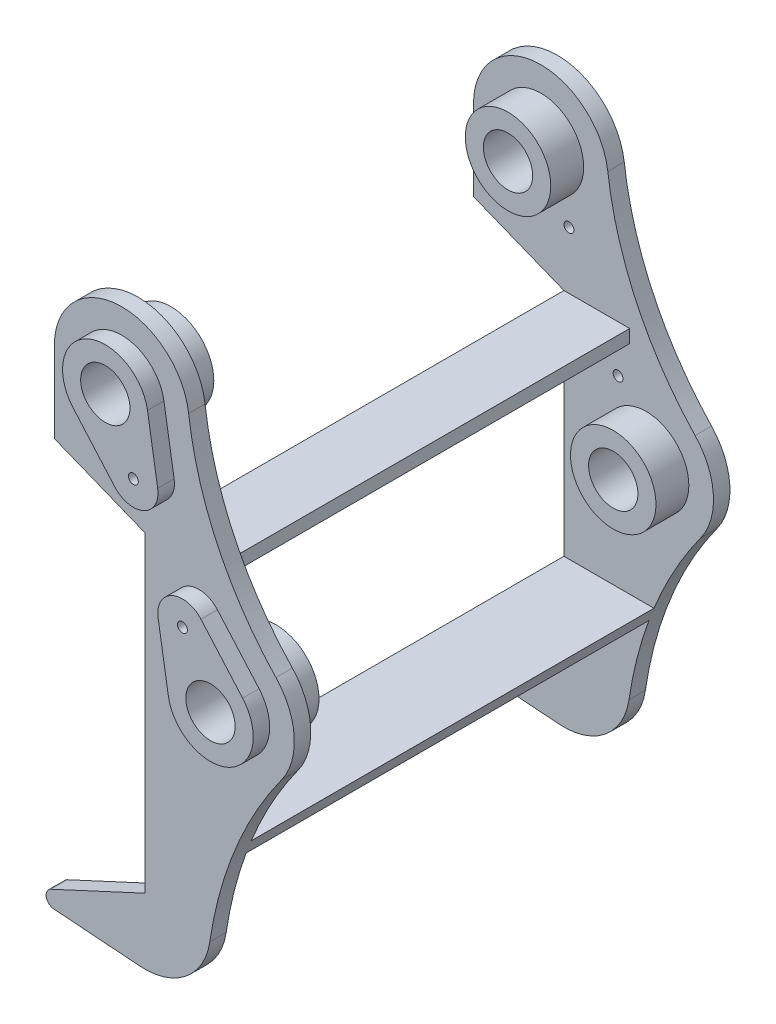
from build123d import *

# Parameters (mm, degrees)
EXTRUDE_START       = 122.5
EXTRUDE_1_DEPTH     = 10
EXTRUDE_START_2     = -132.5
EXTRUDE_4_DEPTH     = 10
EXTRUDE_2_DEPTH     = 10
EXTRUDE_START_3     = 20
SKETCH_3_R          = 26
EXTRUDE_3_DEPTH     = 20
SKETCH_4_R          = 15
SKETCH_4_R_2        = 3
CUT_EXTRUDE_1_DEPTH = 422.011876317
EXTRUDE_START_4     = 10
EXTRUDE_5_DEPTH     = 10
SKETCH_7_R          = 26
EXTRUDE_6_DEPTH     = 20
SKETCH_8_R          = 15
SKETCH_8_R_2        = 3
CUT_EXTRUDE_2_DEPTH = 403.058453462
EXTRUDE_START_5     = -255
SKETCH_9_W          = 40
SKETCH_9_H          = 8
EXTRUDE_7_DEPTH     = 255


with BuildPart() as part:
    # Sketch 1 → Extrude 1 (new body)
    with BuildSketch(Plane.XY.offset(EXTRUDE_START)):
        with BuildLine():
            Line((14, -71), (14, -261))
            Line((14, -261), (-43.10239683, -287.463489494))
            ThreePointArc((-43.10239683, -287.463489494), (-45.919388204, -292.894214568), (-41.371422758, -296.986185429))
            Line((-41.371422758, -296.986185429), (11.028617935, -300.889483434))
            ThreePointArc((11.028617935, -300.889483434), (38.995374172, -292.228693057), (53.571659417, -266.838130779))
            ThreePointArc((53.571659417, -266.838130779), (68.919536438, -210.644979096), (97.199820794, -159.71902165))
            ThreePointArc((97.199820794, -159.71902165), (104.913157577, -132.99422156), (93.795477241, -107.497012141))
            ThreePointArc((93.795477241, -107.497012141), (58.25747792, -55.443365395), (40.683444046, 5.085015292))
            ThreePointArc((40.683444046, 5.085015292), (-2.547429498, 40.920784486), (-41, 0))
            Line((-41, 0), (-41, -49))
            Line((-41, -49), (14, -71))
        make_face()
    extrude(amount=EXTRUDE_1_DEPTH)

    # Sketch 2 → Extrude 2 (add)
    with BuildSketch(Plane.XY.offset(132.5)):
        with BuildLine():
            Line((-19.557341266, -17.132145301), (5.783585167, -46.06028813))
            ThreePointArc((5.783585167, -46.06028813), (23.466666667, -49.742492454), (31.869748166, -33.753802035))
            Line((31.869748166, -33.753802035), (25.658674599, 4.199097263))
            ThreePointArc((25.658674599, 4.199097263), (-11.093333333, 23.514632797), (-19.557341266, -17.132145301))
        make_face()
        with BuildLine():
            Line((32.130251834, -101.907541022), (38.341325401, -139.86044032))
            ThreePointArc((38.341325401, -139.86044032), (75.093333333, -159.175975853), (83.557341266, -118.529197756))
            Line((83.557341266, -118.529197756), (58.216414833, -89.601054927))
            ThreePointArc((58.216414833, -89.601054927), (40.533333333, -85.918850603), (32.130251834, -101.907541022))
        make_face()
    extrude(amount=EXTRUDE_2_DEPTH)

    # Sketch 3 → Extrude 3 (add)
    with BuildSketch(Plane(origin=(0, 0, 122.5), x_dir=(-1, 0, 0), z_dir=(0, 0, -1)).offset(EXTRUDE_START_3)):
        with Locations(Location((0, 0, 0), (0, 0, 180))):
            Circle(SKETCH_3_R)
        with Locations(Location((-64, -135.661343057, 0), (0, 0, 180))):
            Circle(SKETCH_3_R)
    extrude(amount=-EXTRUDE_3_DEPTH)

    # Sketch 4 → Cut-Extrude 1 (cut, through all)
    with BuildSketch(Plane.XY.offset(142.5)):
        Circle(SKETCH_4_R)
        with Locations((64, -135.661343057)):
            Circle(SKETCH_4_R)
        with Locations((46.933333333, -99.484984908)):
            Circle(SKETCH_4_R_2)
        with Locations((17.066666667, -36.176358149)):
            Circle(SKETCH_4_R_2)
    extrude(amount=-CUT_EXTRUDE_1_DEPTH, mode=Mode.SUBTRACT)



with BuildPart() as body_2:
    # Sketch 5 → Extrude 4 (new body)
    with BuildSketch(Plane.XY.offset(EXTRUDE_START_2)):
        with BuildLine():
            Line((14, -261), (-43.10239683, -287.463489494))
            ThreePointArc((-43.10239683, -287.463489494), (-45.919388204, -292.894214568), (-41.371422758, -296.986185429))
            Line((-41.371422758, -296.986185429), (11.028617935, -300.889483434))
            ThreePointArc((11.028617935, -300.889483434), (38.995374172, -292.228693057), (53.571659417, -266.838130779))
            ThreePointArc((53.571659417, -266.838130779), (68.919536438, -210.644979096), (97.199820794, -159.71902165))
            ThreePointArc((97.199820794, -159.71902165), (104.913157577, -132.99422156), (93.795477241, -107.497012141))
            ThreePointArc((93.795477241, -107.497012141), (58.25747792, -55.443365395), (40.683444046, 5.085015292))
            ThreePointArc((40.683444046, 5.085015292), (-2.547429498, 40.920784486), (-41, 0))
            Line((-41, 0), (-41, -49))
            Line((-41, -49), (14, -71))
            Line((14, -71), (14, -261))
        make_face()
    extrude(amount=EXTRUDE_4_DEPTH)

    # Sketch 6 → Extrude 5 (add)
    with BuildSketch(Plane(origin=(0, 0, -132.5), x_dir=(-1, 0, 0), z_dir=(0, 0, -1)).offset(EXTRUDE_START_4)):
        with BuildLine():
            Line((-25.658674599, 4.199097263), (-31.869748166, -33.753802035))
            ThreePointArc((-31.869748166, -33.753802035), (-23.466666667, -49.742492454), (-5.783585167, -46.06028813))
            Line((-5.783585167, -46.06028813), (19.557341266, -17.132145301))
            ThreePointArc((19.557341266, -17.132145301), (11.093333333, 23.514632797), (-25.658674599, 4.199097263))
        make_face()
        with BuildLine():
            Line((-83.557341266, -118.529197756), (-58.216414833, -89.601054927))
            ThreePointArc((-58.216414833, -89.601054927), (-40.533333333, -85.918850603), (-32.130251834, -101.907541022))
            Line((-32.130251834, -101.907541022), (-38.341325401, -139.86044032))
            ThreePointArc((-38.341325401, -139.86044032), (-75.093333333, -159.175975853), (-83.557341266, -118.529197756))
        make_face()
    extrude(amount=-EXTRUDE_5_DEPTH)

    # Sketch 7 → Extrude 6 (add)
    with BuildSketch(Plane.XY.offset(-122.5)):
        Circle(SKETCH_7_R)
        with Locations((64, -135.661343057)):
            Circle(SKETCH_7_R)
    extrude(amount=EXTRUDE_6_DEPTH)

    # Sketch 8 → Cut-Extrude 2 (cut, through all)
    with BuildSketch(Plane.XY.offset(-102.5)):
        Circle(SKETCH_8_R)
        with Locations((17.066666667, -36.176358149)):
            Circle(SKETCH_8_R_2)
        with Locations((46.933333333, -99.484984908)):
            Circle(SKETCH_8_R_2)
        with Locations((64, -135.661343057)):
            Circle(SKETCH_8_R)
    extrude(amount=-CUT_EXTRUDE_2_DEPTH, mode=Mode.SUBTRACT)


with BuildPart() as part_1:
    add(part.part)

    add(body_2.part)  # Extrude 7 merges body 2
    # Sketch 9 → Extrude 7 (add)
    with BuildSketch(Plane.XY.offset(132.5).offset(EXTRUDE_START_5)):
        with BuildLine():
            Line((14, -211), (68.775267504, -211))
            ThreePointArc((68.775267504, -211), (67.199774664, -214.986415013), (65.694843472, -219))
            Line((65.694843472, -219), (14, -219))
            Line((14, -219), (14, -211))
        make_face()
        with Locations((34, -75)):
            Rectangle(SKETCH_9_W, SKETCH_9_H)
    extrude(amount=EXTRUDE_7_DEPTH)


solid = part_1.part
